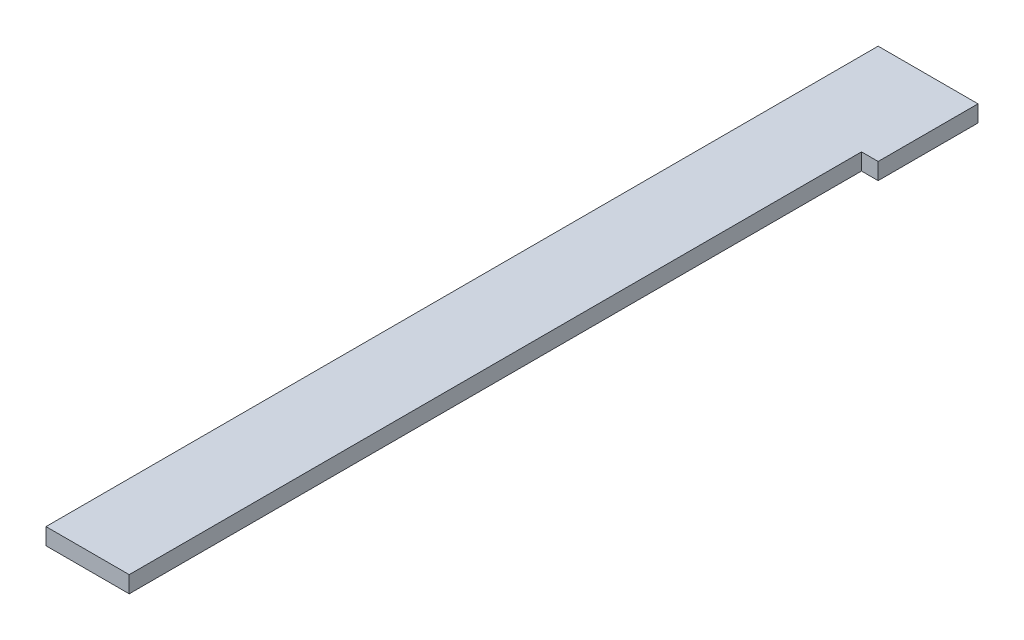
ISO-10303-21;
HEADER;
FILE_DESCRIPTION(('STEP AP214'),'2;1');
FILE_NAME('part.step','',(''),(''),'','','');
FILE_SCHEMA(('AUTOMOTIVE_DESIGN { 1 0 10303 214 1 1 1 1 }'));
ENDSEC;
DATA;
#1=APPLICATION_CONTEXT('core data for automotive mechanical design processes');
#2=APPLICATION_PROTOCOL_DEFINITION('international standard','automotive_design',2000,#1);
#3=PRODUCT_CONTEXT('',#1,'mechanical');
#4=PRODUCT('Part','Part','',(#3));
#5=PRODUCT_RELATED_PRODUCT_CATEGORY('part','',(#4));
#6=PRODUCT_DEFINITION_FORMATION('','',#4);
#7=PRODUCT_DEFINITION_CONTEXT('part definition',#1,'design');
#8=PRODUCT_DEFINITION('design','',#6,#7);
#9=PRODUCT_DEFINITION_SHAPE('','',#8);
#10=(LENGTH_UNIT() NAMED_UNIT(*) SI_UNIT(.MILLI.,.METRE.));
#11=(NAMED_UNIT(*) PLANE_ANGLE_UNIT() SI_UNIT($,.RADIAN.));
#12=(NAMED_UNIT(*) SI_UNIT($,.STERADIAN.) SOLID_ANGLE_UNIT());
#13=UNCERTAINTY_MEASURE_WITH_UNIT(LENGTH_MEASURE(1.E-05),#10,'distance_accuracy_value','');
#14=(GEOMETRIC_REPRESENTATION_CONTEXT(3) GLOBAL_UNCERTAINTY_ASSIGNED_CONTEXT((#13)) GLOBAL_UNIT_ASSIGNED_CONTEXT((#10,
#11,#12)) REPRESENTATION_CONTEXT('',''));
#15=CARTESIAN_POINT('',(0.,0.,0.));
#16=DIRECTION('',(0.,0.,1.));
#17=DIRECTION('',(1.,0.,0.));
#18=AXIS2_PLACEMENT_3D('',#15,#16,#17);
#19=CARTESIAN_POINT('',(50.,10.,0.));
#20=DIRECTION('',(-1.,0.,0.));
#21=DIRECTION('',(0.,0.,1.));
#22=AXIS2_PLACEMENT_3D('',#19,#20,#21);
#23=PLANE('',#22);
#24=DIRECTION('',(0.,-1.,0.));
#25=VECTOR('',#24,1.);
#26=CARTESIAN_POINT('',(50.,9.99999999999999,-440.));
#27=LINE('',#26,#25);
#28=CARTESIAN_POINT('',(50.,9.99999999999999,-440.));
#29=VERTEX_POINT('',#28);
#30=CARTESIAN_POINT('',(50.,0.,-440.));
#31=VERTEX_POINT('',#30);
#32=EDGE_CURVE('E411',#29,#31,#27,.T.);
#33=ORIENTED_EDGE('',*,*,#32,.F.);
#34=DIRECTION('',(0.,0.,-1.));
#35=VECTOR('',#34,1.);
#36=CARTESIAN_POINT('',(50.,10.,0.));
#37=LINE('',#36,#35);
#38=CARTESIAN_POINT('',(50.,10.,0.));
#39=VERTEX_POINT('',#38);
#40=EDGE_CURVE('E355',#39,#29,#37,.T.);
#41=ORIENTED_EDGE('',*,*,#40,.F.);
#42=DIRECTION('',(0.,-1.,0.));
#43=VECTOR('',#42,1.);
#44=CARTESIAN_POINT('',(50.,10.,0.));
#45=LINE('',#44,#43);
#46=CARTESIAN_POINT('',(50.,0.,0.));
#47=VERTEX_POINT('',#46);
#48=EDGE_CURVE('E361',#39,#47,#45,.T.);
#49=ORIENTED_EDGE('',*,*,#48,.T.);
#50=DIRECTION('',(0.,0.,-1.));
#51=VECTOR('',#50,1.);
#52=CARTESIAN_POINT('',(50.,0.,0.));
#53=LINE('',#52,#51);
#54=EDGE_CURVE('E423',#47,#31,#53,.T.);
#55=ORIENTED_EDGE('',*,*,#54,.T.);
#56=EDGE_LOOP('',(#33,#41,#49,#55));
#57=FACE_BOUND('',#56,.T.);
#58=ADVANCED_FACE('F351',(#57),#23,.F.);
#59=CARTESIAN_POINT('',(0.,10.,0.));
#60=DIRECTION('',(1.,0.,0.));
#61=DIRECTION('',(0.,0.,-1.));
#62=AXIS2_PLACEMENT_3D('',#59,#60,#61);
#63=PLANE('',#62);
#64=DIRECTION('',(0.,0.,1.));
#65=VECTOR('',#64,1.);
#66=CARTESIAN_POINT('',(0.,0.,0.));
#67=LINE('',#66,#65);
#68=CARTESIAN_POINT('',(0.,0.,-500.));
#69=VERTEX_POINT('',#68);
#70=CARTESIAN_POINT('',(0.,0.,0.));
#71=VERTEX_POINT('',#70);
#72=EDGE_CURVE('E453',#69,#71,#67,.T.);
#73=ORIENTED_EDGE('',*,*,#72,.T.);
#74=DIRECTION('',(0.,-1.,0.));
#75=VECTOR('',#74,1.);
#76=CARTESIAN_POINT('',(0.,10.,0.));
#77=LINE('',#76,#75);
#78=CARTESIAN_POINT('',(0.,10.,0.));
#79=VERTEX_POINT('',#78);
#80=EDGE_CURVE('E11',#79,#71,#77,.T.);
#81=ORIENTED_EDGE('',*,*,#80,.F.);
#82=DIRECTION('',(0.,0.,1.));
#83=VECTOR('',#82,1.);
#84=CARTESIAN_POINT('',(0.,10.,0.));
#85=LINE('',#84,#83);
#86=CARTESIAN_POINT('',(0.,10.,-500.));
#87=VERTEX_POINT('',#86);
#88=EDGE_CURVE('E428',#87,#79,#85,.T.);
#89=ORIENTED_EDGE('',*,*,#88,.F.);
#90=DIRECTION('',(0.,-1.,0.));
#91=VECTOR('',#90,1.);
#92=CARTESIAN_POINT('',(0.,10.,-500.));
#93=LINE('',#92,#91);
#94=EDGE_CURVE('E426',#87,#69,#93,.T.);
#95=ORIENTED_EDGE('',*,*,#94,.T.);
#96=EDGE_LOOP('',(#73,#81,#89,#95));
#97=FACE_BOUND('',#96,.T.);
#98=ADVANCED_FACE('F353',(#97),#63,.F.);
#99=CARTESIAN_POINT('',(0.,10.,0.));
#100=DIRECTION('',(0.,0.,-1.));
#101=DIRECTION('',(-1.,0.,0.));
#102=AXIS2_PLACEMENT_3D('',#99,#100,#101);
#103=PLANE('',#102);
#104=DIRECTION('',(1.,0.,0.));
#105=VECTOR('',#104,1.);
#106=CARTESIAN_POINT('',(0.,0.,0.));
#107=LINE('',#106,#105);
#108=EDGE_CURVE('E438',#71,#47,#107,.T.);
#109=ORIENTED_EDGE('',*,*,#108,.T.);
#110=ORIENTED_EDGE('',*,*,#48,.F.);
#111=DIRECTION('',(1.,0.,0.));
#112=VECTOR('',#111,1.);
#113=CARTESIAN_POINT('',(0.,10.,0.));
#114=LINE('',#113,#112);
#115=EDGE_CURVE('E375',#79,#39,#114,.T.);
#116=ORIENTED_EDGE('',*,*,#115,.F.);
#117=ORIENTED_EDGE('',*,*,#80,.T.);
#118=EDGE_LOOP('',(#109,#110,#116,#117));
#119=FACE_BOUND('',#118,.T.);
#120=ADVANCED_FACE('F479',(#119),#103,.F.);
#121=CARTESIAN_POINT('',(0.,10.,-500.));
#122=DIRECTION('',(0.,0.,1.));
#123=DIRECTION('',(1.,0.,0.));
#124=AXIS2_PLACEMENT_3D('',#121,#122,#123);
#125=PLANE('',#124);
#126=DIRECTION('',(-1.,0.,0.));
#127=VECTOR('',#126,1.);
#128=CARTESIAN_POINT('',(0.,0.,-500.));
#129=LINE('',#128,#127);
#130=CARTESIAN_POINT('',(60.,0.,-500.));
#131=VERTEX_POINT('',#130);
#132=EDGE_CURVE('E430',#131,#69,#129,.T.);
#133=ORIENTED_EDGE('',*,*,#132,.T.);
#134=ORIENTED_EDGE('',*,*,#94,.F.);
#135=DIRECTION('',(-1.,0.,0.));
#136=VECTOR('',#135,1.);
#137=CARTESIAN_POINT('',(0.,10.,-500.));
#138=LINE('',#137,#136);
#139=CARTESIAN_POINT('',(60.,10.,-500.));
#140=VERTEX_POINT('',#139);
#141=EDGE_CURVE('E369',#140,#87,#138,.T.);
#142=ORIENTED_EDGE('',*,*,#141,.F.);
#143=DIRECTION('',(0.,1.,0.));
#144=VECTOR('',#143,1.);
#145=CARTESIAN_POINT('',(60.,10.,-500.));
#146=LINE('',#145,#144);
#147=EDGE_CURVE('E415',#131,#140,#146,.T.);
#148=ORIENTED_EDGE('',*,*,#147,.F.);
#149=EDGE_LOOP('',(#133,#134,#142,#148));
#150=FACE_BOUND('',#149,.T.);
#151=ADVANCED_FACE('F444',(#150),#125,.F.);
#152=CARTESIAN_POINT('',(0.,10.,-500.));
#153=DIRECTION('',(0.,-1.,0.));
#154=DIRECTION('',(0.,0.,-1.));
#155=AXIS2_PLACEMENT_3D('',#152,#153,#154);
#156=PLANE('',#155);
#157=ORIENTED_EDGE('',*,*,#40,.T.);
#158=DIRECTION('',(-1.,0.,0.));
#159=VECTOR('',#158,1.);
#160=CARTESIAN_POINT('',(60.,9.99999999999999,-440.));
#161=LINE('',#160,#159);
#162=CARTESIAN_POINT('',(60.,9.99999999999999,-440.));
#163=VERTEX_POINT('',#162);
#164=EDGE_CURVE('E407',#163,#29,#161,.T.);
#165=ORIENTED_EDGE('',*,*,#164,.F.);
#166=DIRECTION('',(0.,0.,1.));
#167=VECTOR('',#166,1.);
#168=CARTESIAN_POINT('',(60.,10.,-500.));
#169=LINE('',#168,#167);
#170=EDGE_CURVE('E456',#140,#163,#169,.T.);
#171=ORIENTED_EDGE('',*,*,#170,.F.);
#172=ORIENTED_EDGE('',*,*,#141,.T.);
#173=ORIENTED_EDGE('',*,*,#88,.T.);
#174=ORIENTED_EDGE('',*,*,#115,.T.);
#175=EDGE_LOOP('',(#157,#165,#171,#172,#173,#174));
#176=FACE_BOUND('',#175,.T.);
#177=ADVANCED_FACE('F425',(#176),#156,.F.);
#178=CARTESIAN_POINT('',(0.,0.,-500.));
#179=DIRECTION('',(0.,-1.,0.));
#180=DIRECTION('',(0.,0.,-1.));
#181=AXIS2_PLACEMENT_3D('',#178,#179,#180);
#182=PLANE('',#181);
#183=ORIENTED_EDGE('',*,*,#72,.F.);
#184=ORIENTED_EDGE('',*,*,#132,.F.);
#185=DIRECTION('',(0.,0.,-1.));
#186=VECTOR('',#185,1.);
#187=CARTESIAN_POINT('',(60.,0.,-500.));
#188=LINE('',#187,#186);
#189=CARTESIAN_POINT('',(60.,0.,-440.));
#190=VERTEX_POINT('',#189);
#191=EDGE_CURVE('E455',#190,#131,#188,.T.);
#192=ORIENTED_EDGE('',*,*,#191,.F.);
#193=DIRECTION('',(-1.,0.,0.));
#194=VECTOR('',#193,1.);
#195=CARTESIAN_POINT('',(60.,0.,-440.));
#196=LINE('',#195,#194);
#197=EDGE_CURVE('E416',#190,#31,#196,.T.);
#198=ORIENTED_EDGE('',*,*,#197,.T.);
#199=ORIENTED_EDGE('',*,*,#54,.F.);
#200=ORIENTED_EDGE('',*,*,#108,.F.);
#201=EDGE_LOOP('',(#183,#184,#192,#198,#199,#200));
#202=FACE_BOUND('',#201,.T.);
#203=ADVANCED_FACE('F454',(#202),#182,.T.);
#204=CARTESIAN_POINT('',(60.,0.,-500.));
#205=DIRECTION('',(-1.,0.,0.));
#206=DIRECTION('',(0.,0.,1.));
#207=AXIS2_PLACEMENT_3D('',#204,#205,#206);
#208=PLANE('',#207);
#209=ORIENTED_EDGE('',*,*,#147,.T.);
#210=ORIENTED_EDGE('',*,*,#170,.T.);
#211=DIRECTION('',(0.,-1.,0.));
#212=VECTOR('',#211,1.);
#213=CARTESIAN_POINT('',(60.,9.99999999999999,-440.));
#214=LINE('',#213,#212);
#215=EDGE_CURVE('E414',#163,#190,#214,.T.);
#216=ORIENTED_EDGE('',*,*,#215,.T.);
#217=ORIENTED_EDGE('',*,*,#191,.T.);
#218=EDGE_LOOP('',(#209,#210,#216,#217));
#219=FACE_BOUND('',#218,.T.);
#220=ADVANCED_FACE('F463',(#219),#208,.F.);
#221=CARTESIAN_POINT('',(60.,9.99999999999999,-440.));
#222=DIRECTION('',(0.,0.,-1.));
#223=DIRECTION('',(-1.,0.,0.));
#224=AXIS2_PLACEMENT_3D('',#221,#222,#223);
#225=PLANE('',#224);
#226=ORIENTED_EDGE('',*,*,#32,.T.);
#227=ORIENTED_EDGE('',*,*,#197,.F.);
#228=ORIENTED_EDGE('',*,*,#215,.F.);
#229=ORIENTED_EDGE('',*,*,#164,.T.);
#230=EDGE_LOOP('',(#226,#227,#228,#229));
#231=FACE_BOUND('',#230,.T.);
#232=ADVANCED_FACE('F409',(#231),#225,.F.);
#233=CLOSED_SHELL('',(#58,#98,#120,#151,#177,#203,#220,#232));
#234=MANIFOLD_SOLID_BREP('B2',#233);
#235=ADVANCED_BREP_SHAPE_REPRESENTATION('',(#18,#234),#14);
#236=SHAPE_DEFINITION_REPRESENTATION(#9,#235);
ENDSEC;
END-ISO-10303-21;
